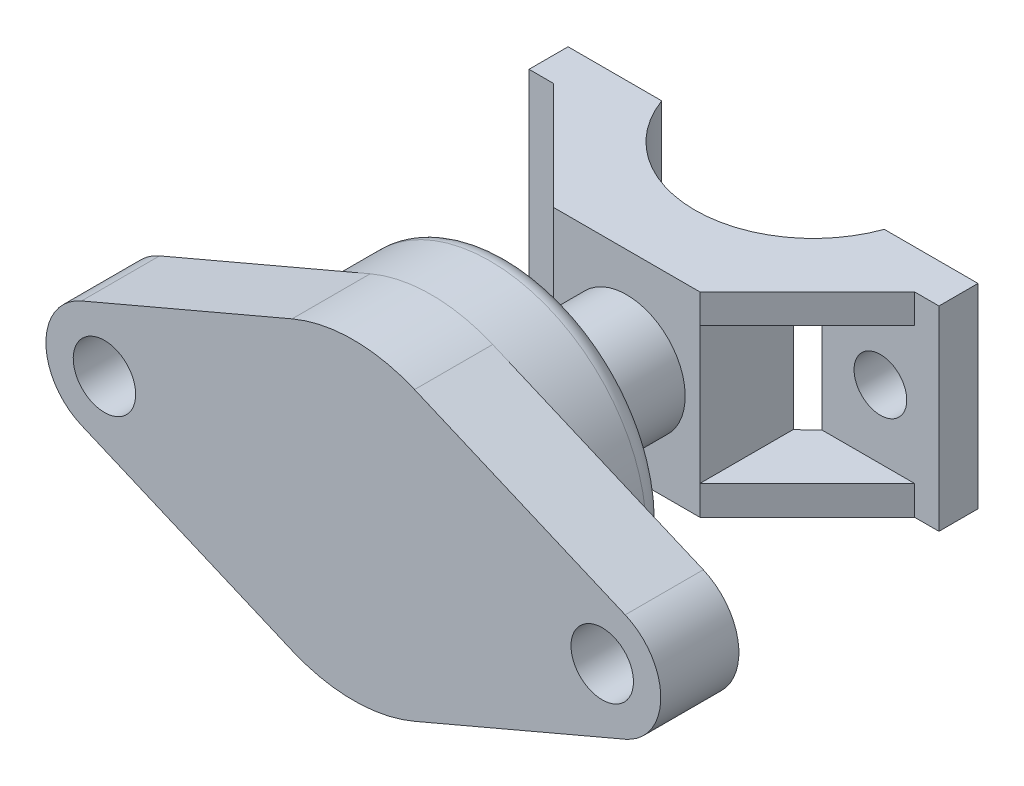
ISO-10303-21;
HEADER;
FILE_DESCRIPTION(('STEP AP214'),'2;1');
FILE_NAME('part.step','',(''),(''),'','','');
FILE_SCHEMA(('AUTOMOTIVE_DESIGN { 1 0 10303 214 1 1 1 1 }'));
ENDSEC;
DATA;
#1=APPLICATION_CONTEXT('core data for automotive mechanical design processes');
#2=APPLICATION_PROTOCOL_DEFINITION('international standard','automotive_design',2000,#1);
#3=PRODUCT_CONTEXT('',#1,'mechanical');
#4=PRODUCT('Part','Part','',(#3));
#5=PRODUCT_RELATED_PRODUCT_CATEGORY('part','',(#4));
#6=PRODUCT_DEFINITION_FORMATION('','',#4);
#7=PRODUCT_DEFINITION_CONTEXT('part definition',#1,'design');
#8=PRODUCT_DEFINITION('design','',#6,#7);
#9=PRODUCT_DEFINITION_SHAPE('','',#8);
#10=(LENGTH_UNIT() NAMED_UNIT(*) SI_UNIT(.MILLI.,.METRE.));
#11=(NAMED_UNIT(*) PLANE_ANGLE_UNIT() SI_UNIT($,.RADIAN.));
#12=(NAMED_UNIT(*) SI_UNIT($,.STERADIAN.) SOLID_ANGLE_UNIT());
#13=UNCERTAINTY_MEASURE_WITH_UNIT(LENGTH_MEASURE(1.E-05),#10,'distance_accuracy_value','');
#14=(GEOMETRIC_REPRESENTATION_CONTEXT(3) GLOBAL_UNCERTAINTY_ASSIGNED_CONTEXT((#13)) GLOBAL_UNIT_ASSIGNED_CONTEXT((#10,
#11,#12)) REPRESENTATION_CONTEXT('',''));
#15=CARTESIAN_POINT('',(0.,0.,0.));
#16=DIRECTION('',(0.,0.,1.));
#17=DIRECTION('',(1.,0.,0.));
#18=AXIS2_PLACEMENT_3D('',#15,#16,#17);
#19=CARTESIAN_POINT('',(15.,22.5,-78.));
#20=DIRECTION('',(0.,0.,1.));
#21=DIRECTION('',(1.,0.,0.));
#22=AXIS2_PLACEMENT_3D('',#19,#20,#21);
#23=CYLINDRICAL_SURFACE('',#22,2.7);
#24=CARTESIAN_POINT('',(15.,22.5,-78.));
#25=DIRECTION('',(0.,0.,1.));
#26=DIRECTION('',(1.,0.,0.));
#27=AXIS2_PLACEMENT_3D('',#24,#25,#26);
#28=CIRCLE('',#27,2.7);
#29=CARTESIAN_POINT('',(15.,25.2,-78.));
#30=VERTEX_POINT('',#29);
#31=EDGE_CURVE('E35',#30,#30,#28,.T.);
#32=ORIENTED_EDGE('',*,*,#31,.F.);
#33=EDGE_LOOP('',(#32));
#34=FACE_BOUND('',#33,.T.);
#35=CARTESIAN_POINT('',(15.,22.5,-74.));
#36=DIRECTION('',(0.,0.,1.));
#37=DIRECTION('',(1.,0.,0.));
#38=AXIS2_PLACEMENT_3D('',#35,#36,#37);
#39=CIRCLE('',#38,2.7);
#40=CARTESIAN_POINT('',(15.,25.2,-74.));
#41=VERTEX_POINT('',#40);
#42=EDGE_CURVE('E400',#41,#41,#39,.F.);
#43=ORIENTED_EDGE('',*,*,#42,.F.);
#44=EDGE_LOOP('',(#43));
#45=FACE_BOUND('',#44,.T.);
#46=ADVANCED_FACE('F16',(#34,#45),#23,.F.);
#47=CARTESIAN_POINT('',(-15.,22.5,-78.));
#48=DIRECTION('',(0.,0.,1.));
#49=DIRECTION('',(1.,0.,0.));
#50=AXIS2_PLACEMENT_3D('',#47,#48,#49);
#51=CYLINDRICAL_SURFACE('',#50,2.7);
#52=CARTESIAN_POINT('',(-15.,22.5,-78.));
#53=DIRECTION('',(0.,0.,1.));
#54=DIRECTION('',(1.,0.,0.));
#55=AXIS2_PLACEMENT_3D('',#52,#53,#54);
#56=CIRCLE('',#55,2.7);
#57=CARTESIAN_POINT('',(-15.,19.8,-78.));
#58=VERTEX_POINT('',#57);
#59=EDGE_CURVE('E19',#58,#58,#56,.T.);
#60=ORIENTED_EDGE('',*,*,#59,.F.);
#61=EDGE_LOOP('',(#60));
#62=FACE_BOUND('',#61,.T.);
#63=CARTESIAN_POINT('',(-15.,22.5,-74.));
#64=DIRECTION('',(0.,0.,1.));
#65=DIRECTION('',(1.,0.,0.));
#66=AXIS2_PLACEMENT_3D('',#63,#64,#65);
#67=CIRCLE('',#66,2.7);
#68=CARTESIAN_POINT('',(-15.,19.8,-74.));
#69=VERTEX_POINT('',#68);
#70=EDGE_CURVE('E418',#69,#69,#67,.F.);
#71=ORIENTED_EDGE('',*,*,#70,.F.);
#72=EDGE_LOOP('',(#71));
#73=FACE_BOUND('',#72,.T.);
#74=ADVANCED_FACE('F983',(#62,#73),#51,.F.);
#75=CARTESIAN_POINT('',(13.,15.5,-68.5));
#76=DIRECTION('',(0.,1.,0.));
#77=DIRECTION('',(0.,0.,1.));
#78=AXIS2_PLACEMENT_3D('',#75,#76,#77);
#79=PLANE('',#78);
#80=CARTESIAN_POINT('',(0.,15.5,-82.125));
#81=DIRECTION('',(0.,1.,0.));
#82=DIRECTION('',(0.,0.,1.));
#83=AXIS2_PLACEMENT_3D('',#80,#81,#82);
#84=CIRCLE('',#83,12.1249999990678);
#85=CARTESIAN_POINT('',(8.9999999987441,15.5,-74.));
#86=VERTEX_POINT('',#85);
#87=CARTESIAN_POINT('',(7.5,15.5,-72.5979004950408));
#88=VERTEX_POINT('',#87);
#89=EDGE_CURVE('E402',#86,#88,#84,.F.);
#90=ORIENTED_EDGE('',*,*,#89,.T.);
#91=DIRECTION('',(0.,0.,-1.));
#92=VECTOR('',#91,1.);
#93=CARTESIAN_POINT('',(7.5,15.5,-68.5));
#94=LINE('',#93,#92);
#95=CARTESIAN_POINT('',(7.5,15.5,-63.));
#96=VERTEX_POINT('',#95);
#97=EDGE_CURVE('E430',#96,#88,#94,.T.);
#98=ORIENTED_EDGE('',*,*,#97,.F.);
#99=DIRECTION('',(0.707106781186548,0.,-0.707106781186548));
#100=VECTOR('',#99,1.);
#101=CARTESIAN_POINT('',(7.5,15.5,-63.));
#102=LINE('',#101,#100);
#103=CARTESIAN_POINT('',(18.5,15.5,-74.));
#104=VERTEX_POINT('',#103);
#105=EDGE_CURVE('E317',#104,#96,#102,.F.);
#106=ORIENTED_EDGE('',*,*,#105,.F.);
#107=DIRECTION('',(1.,0.,0.));
#108=VECTOR('',#107,1.);
#109=CARTESIAN_POINT('',(18.5,15.5,-74.));
#110=LINE('',#109,#108);
#111=EDGE_CURVE('E461',#86,#104,#110,.T.);
#112=ORIENTED_EDGE('',*,*,#111,.F.);
#113=EDGE_LOOP('',(#90,#98,#106,#112));
#114=FACE_BOUND('',#113,.T.);
#115=ADVANCED_FACE('F975',(#114),#79,.T.);
#116=CARTESIAN_POINT('',(13.,29.5,-68.5));
#117=DIRECTION('',(0.,-1.,0.));
#118=DIRECTION('',(0.,0.,-1.));
#119=AXIS2_PLACEMENT_3D('',#116,#117,#118);
#120=PLANE('',#119);
#121=CARTESIAN_POINT('',(0.,29.5,-82.125));
#122=DIRECTION('',(0.,1.,0.));
#123=DIRECTION('',(0.,0.,1.));
#124=AXIS2_PLACEMENT_3D('',#121,#122,#123);
#125=CIRCLE('',#124,12.1249999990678);
#126=CARTESIAN_POINT('',(7.5,29.5,-72.5979004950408));
#127=VERTEX_POINT('',#126);
#128=CARTESIAN_POINT('',(8.9999999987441,29.5,-74.));
#129=VERTEX_POINT('',#128);
#130=EDGE_CURVE('E507',#127,#129,#125,.T.);
#131=ORIENTED_EDGE('',*,*,#130,.T.);
#132=DIRECTION('',(1.,0.,0.));
#133=VECTOR('',#132,1.);
#134=CARTESIAN_POINT('',(18.5,29.5,-74.));
#135=LINE('',#134,#133);
#136=CARTESIAN_POINT('',(18.5,29.5,-74.));
#137=VERTEX_POINT('',#136);
#138=EDGE_CURVE('E388',#137,#129,#135,.F.);
#139=ORIENTED_EDGE('',*,*,#138,.F.);
#140=DIRECTION('',(0.707106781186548,0.,-0.707106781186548));
#141=VECTOR('',#140,1.);
#142=CARTESIAN_POINT('',(7.5,29.5,-63.));
#143=LINE('',#142,#141);
#144=CARTESIAN_POINT('',(7.5,29.5,-63.));
#145=VERTEX_POINT('',#144);
#146=EDGE_CURVE('E433',#145,#137,#143,.T.);
#147=ORIENTED_EDGE('',*,*,#146,.F.);
#148=DIRECTION('',(0.,0.,-1.));
#149=VECTOR('',#148,1.);
#150=CARTESIAN_POINT('',(7.5,29.5,-68.5));
#151=LINE('',#150,#149);
#152=EDGE_CURVE('E429',#127,#145,#151,.F.);
#153=ORIENTED_EDGE('',*,*,#152,.F.);
#154=EDGE_LOOP('',(#131,#139,#147,#153));
#155=FACE_BOUND('',#154,.T.);
#156=ADVANCED_FACE('F968',(#155),#120,.T.);
#157=CARTESIAN_POINT('',(-21.,32.5,-78.));
#158=DIRECTION('',(-1.,0.,0.));
#159=DIRECTION('',(0.,0.,1.));
#160=AXIS2_PLACEMENT_3D('',#157,#158,#159);
#161=PLANE('',#160);
#162=DIRECTION('',(0.,0.,-1.));
#163=VECTOR('',#162,1.);
#164=CARTESIAN_POINT('',(-21.,32.5,-71.560139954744));
#165=LINE('',#164,#163);
#166=CARTESIAN_POINT('',(-21.,32.5,-74.));
#167=VERTEX_POINT('',#166);
#168=CARTESIAN_POINT('',(-21.,32.5,-78.));
#169=VERTEX_POINT('',#168);
#170=EDGE_CURVE('E310',#167,#169,#165,.T.);
#171=ORIENTED_EDGE('',*,*,#170,.T.);
#172=DIRECTION('',(0.,1.,0.));
#173=VECTOR('',#172,1.);
#174=CARTESIAN_POINT('',(-21.,32.5,-78.));
#175=LINE('',#174,#173);
#176=CARTESIAN_POINT('',(-21.,12.5,-78.));
#177=VERTEX_POINT('',#176);
#178=EDGE_CURVE('E403',#177,#169,#175,.T.);
#179=ORIENTED_EDGE('',*,*,#178,.F.);
#180=DIRECTION('',(0.,0.,-1.));
#181=VECTOR('',#180,1.);
#182=CARTESIAN_POINT('',(-21.,12.5,-71.560139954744));
#183=LINE('',#182,#181);
#184=CARTESIAN_POINT('',(-21.,12.5,-74.));
#185=VERTEX_POINT('',#184);
#186=EDGE_CURVE('E330',#185,#177,#183,.T.);
#187=ORIENTED_EDGE('',*,*,#186,.F.);
#188=DIRECTION('',(0.,1.,0.));
#189=VECTOR('',#188,1.);
#190=CARTESIAN_POINT('',(-21.,32.5,-74.));
#191=LINE('',#190,#189);
#192=EDGE_CURVE('E377',#167,#185,#191,.F.);
#193=ORIENTED_EDGE('',*,*,#192,.F.);
#194=EDGE_LOOP('',(#171,#179,#187,#193));
#195=FACE_BOUND('',#194,.T.);
#196=ADVANCED_FACE('F577',(#195),#161,.T.);
#197=CARTESIAN_POINT('',(-11.40175425,32.5,-78.));
#198=DIRECTION('',(0.,0.,-1.));
#199=DIRECTION('',(-1.,0.,0.));
#200=AXIS2_PLACEMENT_3D('',#197,#198,#199);
#201=PLANE('',#200);
#202=ORIENTED_EDGE('',*,*,#59,.T.);
#203=EDGE_LOOP('',(#202));
#204=FACE_BOUND('',#203,.T.);
#205=DIRECTION('',(1.,0.,0.));
#206=VECTOR('',#205,1.);
#207=CARTESIAN_POINT('',(0.,32.5,-78.));
#208=LINE('',#207,#206);
#209=CARTESIAN_POINT('',(-11.40175425,32.5,-78.));
#210=VERTEX_POINT('',#209);
#211=EDGE_CURVE('E308',#169,#210,#208,.T.);
#212=ORIENTED_EDGE('',*,*,#211,.T.);
#213=DIRECTION('',(0.,1.,0.));
#214=VECTOR('',#213,1.);
#215=CARTESIAN_POINT('',(-11.40175425,32.5,-78.));
#216=LINE('',#215,#214);
#217=CARTESIAN_POINT('',(-11.40175425,12.5,-78.));
#218=VERTEX_POINT('',#217);
#219=EDGE_CURVE('E399',#210,#218,#216,.F.);
#220=ORIENTED_EDGE('',*,*,#219,.T.);
#221=DIRECTION('',(1.,0.,0.));
#222=VECTOR('',#221,1.);
#223=CARTESIAN_POINT('',(0.,12.5,-78.));
#224=LINE('',#223,#222);
#225=EDGE_CURVE('E327',#177,#218,#224,.T.);
#226=ORIENTED_EDGE('',*,*,#225,.F.);
#227=ORIENTED_EDGE('',*,*,#178,.T.);
#228=EDGE_LOOP('',(#212,#220,#226,#227));
#229=FACE_BOUND('',#228,.T.);
#230=ADVANCED_FACE('F573',(#204,#229),#201,.T.);
#231=CARTESIAN_POINT('',(21.,32.5,-78.));
#232=DIRECTION('',(0.,0.,-1.));
#233=DIRECTION('',(-1.,0.,0.));
#234=AXIS2_PLACEMENT_3D('',#231,#232,#233);
#235=PLANE('',#234);
#236=ORIENTED_EDGE('',*,*,#31,.T.);
#237=EDGE_LOOP('',(#236));
#238=FACE_BOUND('',#237,.T.);
#239=DIRECTION('',(1.,0.,0.));
#240=VECTOR('',#239,1.);
#241=CARTESIAN_POINT('',(0.,32.5,-78.));
#242=LINE('',#241,#240);
#243=CARTESIAN_POINT('',(11.40175425,32.5,-78.));
#244=VERTEX_POINT('',#243);
#245=CARTESIAN_POINT('',(21.,32.5,-78.));
#246=VERTEX_POINT('',#245);
#247=EDGE_CURVE('E303',#244,#246,#242,.T.);
#248=ORIENTED_EDGE('',*,*,#247,.T.);
#249=DIRECTION('',(0.,1.,0.));
#250=VECTOR('',#249,1.);
#251=CARTESIAN_POINT('',(21.,32.5,-78.));
#252=LINE('',#251,#250);
#253=CARTESIAN_POINT('',(21.,12.5,-78.));
#254=VERTEX_POINT('',#253);
#255=EDGE_CURVE('E389',#254,#246,#252,.T.);
#256=ORIENTED_EDGE('',*,*,#255,.F.);
#257=DIRECTION('',(1.,0.,0.));
#258=VECTOR('',#257,1.);
#259=CARTESIAN_POINT('',(0.,12.5,-78.));
#260=LINE('',#259,#258);
#261=CARTESIAN_POINT('',(11.40175425,12.5,-78.));
#262=VERTEX_POINT('',#261);
#263=EDGE_CURVE('E321',#262,#254,#260,.T.);
#264=ORIENTED_EDGE('',*,*,#263,.F.);
#265=DIRECTION('',(0.,1.,0.));
#266=VECTOR('',#265,1.);
#267=CARTESIAN_POINT('',(11.40175425,32.5,-78.));
#268=LINE('',#267,#266);
#269=EDGE_CURVE('E397',#262,#244,#268,.T.);
#270=ORIENTED_EDGE('',*,*,#269,.T.);
#271=EDGE_LOOP('',(#248,#256,#264,#270));
#272=FACE_BOUND('',#271,.T.);
#273=ADVANCED_FACE('F576',(#238,#272),#235,.T.);
#274=CARTESIAN_POINT('',(21.,32.5,-74.));
#275=DIRECTION('',(1.,0.,0.));
#276=DIRECTION('',(0.,0.,-1.));
#277=AXIS2_PLACEMENT_3D('',#274,#275,#276);
#278=PLANE('',#277);
#279=DIRECTION('',(0.,0.,-1.));
#280=VECTOR('',#279,1.);
#281=CARTESIAN_POINT('',(21.,32.5,-71.560139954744));
#282=LINE('',#281,#280);
#283=CARTESIAN_POINT('',(21.,32.5,-74.));
#284=VERTEX_POINT('',#283);
#285=EDGE_CURVE('E302',#246,#284,#282,.F.);
#286=ORIENTED_EDGE('',*,*,#285,.T.);
#287=DIRECTION('',(0.,1.,0.));
#288=VECTOR('',#287,1.);
#289=CARTESIAN_POINT('',(21.,32.5,-74.));
#290=LINE('',#289,#288);
#291=CARTESIAN_POINT('',(21.,12.5,-74.));
#292=VERTEX_POINT('',#291);
#293=EDGE_CURVE('E385',#292,#284,#290,.T.);
#294=ORIENTED_EDGE('',*,*,#293,.F.);
#295=DIRECTION('',(0.,0.,-1.));
#296=VECTOR('',#295,1.);
#297=CARTESIAN_POINT('',(21.,12.5,-71.560139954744));
#298=LINE('',#297,#296);
#299=EDGE_CURVE('E320',#254,#292,#298,.F.);
#300=ORIENTED_EDGE('',*,*,#299,.F.);
#301=ORIENTED_EDGE('',*,*,#255,.T.);
#302=EDGE_LOOP('',(#286,#294,#300,#301));
#303=FACE_BOUND('',#302,.T.);
#304=ADVANCED_FACE('F597',(#303),#278,.T.);
#305=CARTESIAN_POINT('',(18.5,32.5,-74.));
#306=DIRECTION('',(0.,0.,1.));
#307=DIRECTION('',(1.,0.,0.));
#308=AXIS2_PLACEMENT_3D('',#305,#306,#307);
#309=PLANE('',#308);
#310=ORIENTED_EDGE('',*,*,#42,.T.);
#311=EDGE_LOOP('',(#310));
#312=FACE_BOUND('',#311,.T.);
#313=ORIENTED_EDGE('',*,*,#111,.T.);
#314=DIRECTION('',(0.,1.,0.));
#315=VECTOR('',#314,1.);
#316=CARTESIAN_POINT('',(18.5,32.5,-74.));
#317=LINE('',#316,#315);
#318=CARTESIAN_POINT('',(18.5,12.5,-74.));
#319=VERTEX_POINT('',#318);
#320=EDGE_CURVE('E316',#319,#104,#317,.T.);
#321=ORIENTED_EDGE('',*,*,#320,.F.);
#322=DIRECTION('',(1.,0.,0.));
#323=VECTOR('',#322,1.);
#324=CARTESIAN_POINT('',(0.,12.5,-74.));
#325=LINE('',#324,#323);
#326=EDGE_CURVE('E318',#292,#319,#325,.F.);
#327=ORIENTED_EDGE('',*,*,#326,.F.);
#328=ORIENTED_EDGE('',*,*,#293,.T.);
#329=DIRECTION('',(1.,0.,0.));
#330=VECTOR('',#329,1.);
#331=CARTESIAN_POINT('',(0.,32.5,-74.));
#332=LINE('',#331,#330);
#333=CARTESIAN_POINT('',(18.5,32.5,-74.));
#334=VERTEX_POINT('',#333);
#335=EDGE_CURVE('E300',#284,#334,#332,.F.);
#336=ORIENTED_EDGE('',*,*,#335,.T.);
#337=DIRECTION('',(0.,1.,0.));
#338=VECTOR('',#337,1.);
#339=CARTESIAN_POINT('',(18.5,32.5,-74.));
#340=LINE('',#339,#338);
#341=EDGE_CURVE('E414',#137,#334,#340,.T.);
#342=ORIENTED_EDGE('',*,*,#341,.F.);
#343=ORIENTED_EDGE('',*,*,#138,.T.);
#344=DIRECTION('',(0.,1.,0.));
#345=VECTOR('',#344,1.);
#346=CARTESIAN_POINT('',(8.99999999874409,32.5,-74.));
#347=LINE('',#346,#345);
#348=EDGE_CURVE('E503',#129,#86,#347,.F.);
#349=ORIENTED_EDGE('',*,*,#348,.T.);
#350=EDGE_LOOP('',(#313,#321,#327,#328,#336,#342,#343,#349));
#351=FACE_BOUND('',#350,.T.);
#352=ADVANCED_FACE('F620',(#312,#351),#309,.T.);
#353=CARTESIAN_POINT('',(0.,32.5,-82.125));
#354=DIRECTION('',(0.,1.,0.));
#355=DIRECTION('',(0.,0.,1.));
#356=AXIS2_PLACEMENT_3D('',#353,#354,#355);
#357=CYLINDRICAL_SURFACE('',#356,12.1249999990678);
#358=CARTESIAN_POINT('',(0.,15.5,-82.125));
#359=DIRECTION('',(0.,1.,0.));
#360=DIRECTION('',(0.,0.,1.));
#361=AXIS2_PLACEMENT_3D('',#358,#359,#360);
#362=CIRCLE('',#361,12.1249999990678);
#363=CARTESIAN_POINT('',(-7.5,15.5,-72.5979004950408));
#364=VERTEX_POINT('',#363);
#365=CARTESIAN_POINT('',(-8.99999999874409,15.5,-74.));
#366=VERTEX_POINT('',#365);
#367=EDGE_CURVE('E496',#364,#366,#362,.F.);
#368=ORIENTED_EDGE('',*,*,#367,.F.);
#369=DIRECTION('',(0.,1.,0.));
#370=VECTOR('',#369,1.);
#371=CARTESIAN_POINT('',(-7.5,22.5,-72.5979004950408));
#372=LINE('',#371,#370);
#373=CARTESIAN_POINT('',(-7.5,29.5,-72.5979004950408));
#374=VERTEX_POINT('',#373);
#375=EDGE_CURVE('E333',#374,#364,#372,.F.);
#376=ORIENTED_EDGE('',*,*,#375,.F.);
#377=CARTESIAN_POINT('',(0.,29.5,-82.125));
#378=DIRECTION('',(0.,1.,0.));
#379=DIRECTION('',(0.,0.,1.));
#380=AXIS2_PLACEMENT_3D('',#377,#378,#379);
#381=CIRCLE('',#380,12.1249999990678);
#382=CARTESIAN_POINT('',(-8.99999999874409,29.5,-74.));
#383=VERTEX_POINT('',#382);
#384=EDGE_CURVE('E506',#383,#374,#381,.T.);
#385=ORIENTED_EDGE('',*,*,#384,.F.);
#386=DIRECTION('',(0.,1.,0.));
#387=VECTOR('',#386,1.);
#388=CARTESIAN_POINT('',(-8.99999999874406,32.5,-74.));
#389=LINE('',#388,#387);
#390=EDGE_CURVE('E378',#366,#383,#389,.T.);
#391=ORIENTED_EDGE('',*,*,#390,.F.);
#392=EDGE_LOOP('',(#368,#376,#385,#391));
#393=FACE_BOUND('',#392,.T.);
#394=ORIENTED_EDGE('',*,*,#130,.F.);
#395=DIRECTION('',(0.,1.,0.));
#396=VECTOR('',#395,1.);
#397=CARTESIAN_POINT('',(7.5,22.5,-72.5979004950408));
#398=LINE('',#397,#396);
#399=EDGE_CURVE('E426',#88,#127,#398,.T.);
#400=ORIENTED_EDGE('',*,*,#399,.F.);
#401=ORIENTED_EDGE('',*,*,#89,.F.);
#402=ORIENTED_EDGE('',*,*,#348,.F.);
#403=EDGE_LOOP('',(#394,#400,#401,#402));
#404=FACE_BOUND('',#403,.T.);
#405=ORIENTED_EDGE('',*,*,#219,.F.);
#406=CARTESIAN_POINT('',(0.,32.5,-82.125));
#407=DIRECTION('',(0.,1.,0.));
#408=DIRECTION('',(0.,0.,1.));
#409=AXIS2_PLACEMENT_3D('',#406,#407,#408);
#410=CIRCLE('',#409,12.1249999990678);
#411=EDGE_CURVE('E305',#210,#244,#410,.T.);
#412=ORIENTED_EDGE('',*,*,#411,.T.);
#413=ORIENTED_EDGE('',*,*,#269,.F.);
#414=CARTESIAN_POINT('',(0.,12.5,-82.125));
#415=DIRECTION('',(0.,1.,0.));
#416=DIRECTION('',(0.,0.,1.));
#417=AXIS2_PLACEMENT_3D('',#414,#415,#416);
#418=CIRCLE('',#417,12.1249999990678);
#419=EDGE_CURVE('E324',#218,#262,#418,.T.);
#420=ORIENTED_EDGE('',*,*,#419,.F.);
#421=EDGE_LOOP('',(#405,#412,#413,#420));
#422=FACE_BOUND('',#421,.T.);
#423=ADVANCED_FACE('F587',(#393,#404,#422),#357,.F.);
#424=CARTESIAN_POINT('',(-13.,29.5,-68.5));
#425=DIRECTION('',(0.,-1.,0.));
#426=DIRECTION('',(0.,0.,-1.));
#427=AXIS2_PLACEMENT_3D('',#424,#425,#426);
#428=PLANE('',#427);
#429=DIRECTION('',(0.707106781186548,0.,0.707106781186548));
#430=VECTOR('',#429,1.);
#431=CARTESIAN_POINT('',(-18.5,29.5,-74.));
#432=LINE('',#431,#430);
#433=CARTESIAN_POINT('',(-18.5,29.5,-74.));
#434=VERTEX_POINT('',#433);
#435=CARTESIAN_POINT('',(-7.5,29.5,-63.));
#436=VERTEX_POINT('',#435);
#437=EDGE_CURVE('E299',#434,#436,#432,.T.);
#438=ORIENTED_EDGE('',*,*,#437,.F.);
#439=DIRECTION('',(1.,0.,0.));
#440=VECTOR('',#439,1.);
#441=CARTESIAN_POINT('',(-21.,29.5,-74.));
#442=LINE('',#441,#440);
#443=EDGE_CURVE('E374',#383,#434,#442,.F.);
#444=ORIENTED_EDGE('',*,*,#443,.F.);
#445=ORIENTED_EDGE('',*,*,#384,.T.);
#446=DIRECTION('',(0.,0.,1.));
#447=VECTOR('',#446,1.);
#448=CARTESIAN_POINT('',(-7.5,29.5,-68.5));
#449=LINE('',#448,#447);
#450=EDGE_CURVE('E338',#436,#374,#449,.F.);
#451=ORIENTED_EDGE('',*,*,#450,.F.);
#452=EDGE_LOOP('',(#438,#444,#445,#451));
#453=FACE_BOUND('',#452,.T.);
#454=ADVANCED_FACE('F638',(#453),#428,.T.);
#455=CARTESIAN_POINT('',(-13.,15.5,-68.5));
#456=DIRECTION('',(0.,1.,0.));
#457=DIRECTION('',(0.,0.,1.));
#458=AXIS2_PLACEMENT_3D('',#455,#456,#457);
#459=PLANE('',#458);
#460=DIRECTION('',(0.707106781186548,0.,0.707106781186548));
#461=VECTOR('',#460,1.);
#462=CARTESIAN_POINT('',(-18.5,15.5,-74.));
#463=LINE('',#462,#461);
#464=CARTESIAN_POINT('',(-7.5,15.5,-63.));
#465=VERTEX_POINT('',#464);
#466=CARTESIAN_POINT('',(-18.5,15.5,-74.));
#467=VERTEX_POINT('',#466);
#468=EDGE_CURVE('E341',#465,#467,#463,.F.);
#469=ORIENTED_EDGE('',*,*,#468,.F.);
#470=DIRECTION('',(0.,0.,1.));
#471=VECTOR('',#470,1.);
#472=CARTESIAN_POINT('',(-7.5,15.5,-68.5));
#473=LINE('',#472,#471);
#474=EDGE_CURVE('E336',#364,#465,#473,.T.);
#475=ORIENTED_EDGE('',*,*,#474,.F.);
#476=ORIENTED_EDGE('',*,*,#367,.T.);
#477=DIRECTION('',(1.,0.,0.));
#478=VECTOR('',#477,1.);
#479=CARTESIAN_POINT('',(-21.,15.5,-74.));
#480=LINE('',#479,#478);
#481=EDGE_CURVE('E493',#467,#366,#480,.T.);
#482=ORIENTED_EDGE('',*,*,#481,.F.);
#483=EDGE_LOOP('',(#469,#475,#476,#482));
#484=FACE_BOUND('',#483,.T.);
#485=ADVANCED_FACE('F633',(#484),#459,.T.);
#486=CARTESIAN_POINT('',(-21.,32.5,-74.));
#487=DIRECTION('',(0.,0.,1.));
#488=DIRECTION('',(1.,0.,0.));
#489=AXIS2_PLACEMENT_3D('',#486,#487,#488);
#490=PLANE('',#489);
#491=ORIENTED_EDGE('',*,*,#70,.T.);
#492=EDGE_LOOP('',(#491));
#493=FACE_BOUND('',#492,.T.);
#494=DIRECTION('',(1.,0.,0.));
#495=VECTOR('',#494,1.);
#496=CARTESIAN_POINT('',(0.,32.5,-74.));
#497=LINE('',#496,#495);
#498=CARTESIAN_POINT('',(-18.5,32.5,-74.));
#499=VERTEX_POINT('',#498);
#500=EDGE_CURVE('E409',#499,#167,#497,.F.);
#501=ORIENTED_EDGE('',*,*,#500,.T.);
#502=ORIENTED_EDGE('',*,*,#192,.T.);
#503=DIRECTION('',(1.,0.,0.));
#504=VECTOR('',#503,1.);
#505=CARTESIAN_POINT('',(0.,12.5,-74.));
#506=LINE('',#505,#504);
#507=CARTESIAN_POINT('',(-18.5,12.5,-74.));
#508=VERTEX_POINT('',#507);
#509=EDGE_CURVE('E476',#508,#185,#506,.F.);
#510=ORIENTED_EDGE('',*,*,#509,.F.);
#511=DIRECTION('',(0.,1.,0.));
#512=VECTOR('',#511,1.);
#513=CARTESIAN_POINT('',(-18.5,32.5,-74.));
#514=LINE('',#513,#512);
#515=EDGE_CURVE('E366',#467,#508,#514,.F.);
#516=ORIENTED_EDGE('',*,*,#515,.F.);
#517=ORIENTED_EDGE('',*,*,#481,.T.);
#518=ORIENTED_EDGE('',*,*,#390,.T.);
#519=ORIENTED_EDGE('',*,*,#443,.T.);
#520=DIRECTION('',(0.,1.,0.));
#521=VECTOR('',#520,1.);
#522=CARTESIAN_POINT('',(-18.5,32.5,-74.));
#523=LINE('',#522,#521);
#524=EDGE_CURVE('E337',#499,#434,#523,.F.);
#525=ORIENTED_EDGE('',*,*,#524,.F.);
#526=EDGE_LOOP('',(#501,#502,#510,#516,#517,#518,#519,#525));
#527=FACE_BOUND('',#526,.T.);
#528=ADVANCED_FACE('F608',(#493,#527),#490,.T.);
#529=CARTESIAN_POINT('',(0.,12.5,-71.560139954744));
#530=DIRECTION('',(0.,-1.,0.));
#531=DIRECTION('',(0.,0.,-1.));
#532=AXIS2_PLACEMENT_3D('',#529,#530,#531);
#533=PLANE('',#532);
#534=ORIENTED_EDGE('',*,*,#299,.T.);
#535=ORIENTED_EDGE('',*,*,#326,.T.);
#536=DIRECTION('',(0.707106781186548,0.,-0.707106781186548));
#537=VECTOR('',#536,1.);
#538=CARTESIAN_POINT('',(7.5,12.5,-63.));
#539=LINE('',#538,#537);
#540=CARTESIAN_POINT('',(7.5,12.5,-63.));
#541=VERTEX_POINT('',#540);
#542=EDGE_CURVE('E313',#541,#319,#539,.T.);
#543=ORIENTED_EDGE('',*,*,#542,.F.);
#544=DIRECTION('',(1.,0.,0.));
#545=VECTOR('',#544,1.);
#546=CARTESIAN_POINT('',(0.,12.5,-63.));
#547=LINE('',#546,#545);
#548=CARTESIAN_POINT('',(-7.5,12.5,-63.));
#549=VERTEX_POINT('',#548);
#550=EDGE_CURVE('E292',#549,#541,#547,.T.);
#551=ORIENTED_EDGE('',*,*,#550,.F.);
#552=DIRECTION('',(0.707106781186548,0.,0.707106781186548));
#553=VECTOR('',#552,1.);
#554=CARTESIAN_POINT('',(-18.5,12.5,-74.));
#555=LINE('',#554,#553);
#556=EDGE_CURVE('E296',#508,#549,#555,.T.);
#557=ORIENTED_EDGE('',*,*,#556,.F.);
#558=ORIENTED_EDGE('',*,*,#509,.T.);
#559=ORIENTED_EDGE('',*,*,#186,.T.);
#560=ORIENTED_EDGE('',*,*,#225,.T.);
#561=ORIENTED_EDGE('',*,*,#419,.T.);
#562=ORIENTED_EDGE('',*,*,#263,.T.);
#563=EDGE_LOOP('',(#534,#535,#543,#551,#557,#558,#559,#560,#561,#562));
#564=FACE_BOUND('',#563,.T.);
#565=ADVANCED_FACE('F600',(#564),#533,.T.);
#566=CARTESIAN_POINT('',(7.5,32.5,-63.));
#567=DIRECTION('',(0.707106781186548,0.,0.707106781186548));
#568=DIRECTION('',(0.707106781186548,0.,-0.707106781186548));
#569=AXIS2_PLACEMENT_3D('',#566,#567,#568);
#570=PLANE('',#569);
#571=ORIENTED_EDGE('',*,*,#542,.T.);
#572=ORIENTED_EDGE('',*,*,#320,.T.);
#573=ORIENTED_EDGE('',*,*,#105,.T.);
#574=DIRECTION('',(0.,1.,0.));
#575=VECTOR('',#574,1.);
#576=CARTESIAN_POINT('',(7.5,32.5,-63.));
#577=LINE('',#576,#575);
#578=EDGE_CURVE('E295',#541,#96,#577,.T.);
#579=ORIENTED_EDGE('',*,*,#578,.F.);
#580=EDGE_LOOP('',(#571,#572,#573,#579));
#581=FACE_BOUND('',#580,.T.);
#582=ADVANCED_FACE('F625',(#581),#570,.T.);
#583=CARTESIAN_POINT('',(7.5,22.5,-68.5));
#584=DIRECTION('',(1.,0.,0.));
#585=DIRECTION('',(0.,0.,-1.));
#586=AXIS2_PLACEMENT_3D('',#583,#584,#585);
#587=PLANE('',#586);
#588=DIRECTION('',(0.,1.,0.));
#589=VECTOR('',#588,1.);
#590=CARTESIAN_POINT('',(7.5,32.5,-63.));
#591=LINE('',#590,#589);
#592=EDGE_CURVE('E440',#96,#145,#591,.T.);
#593=ORIENTED_EDGE('',*,*,#592,.F.);
#594=ORIENTED_EDGE('',*,*,#97,.T.);
#595=ORIENTED_EDGE('',*,*,#399,.T.);
#596=ORIENTED_EDGE('',*,*,#152,.T.);
#597=EDGE_LOOP('',(#593,#594,#595,#596));
#598=FACE_BOUND('',#597,.T.);
#599=ADVANCED_FACE('F894',(#598),#587,.T.);
#600=CARTESIAN_POINT('',(7.5,32.5,-63.));
#601=DIRECTION('',(0.707106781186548,0.,0.707106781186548));
#602=DIRECTION('',(0.707106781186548,0.,-0.707106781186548));
#603=AXIS2_PLACEMENT_3D('',#600,#601,#602);
#604=PLANE('',#603);
#605=DIRECTION('',(-0.707106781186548,0.,0.707106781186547));
#606=VECTOR('',#605,1.);
#607=CARTESIAN_POINT('',(18.5,32.5,-74.));
#608=LINE('',#607,#606);
#609=CARTESIAN_POINT('',(7.5,32.5,-63.));
#610=VERTEX_POINT('',#609);
#611=EDGE_CURVE('E297',#334,#610,#608,.T.);
#612=ORIENTED_EDGE('',*,*,#611,.T.);
#613=DIRECTION('',(0.,1.,0.));
#614=VECTOR('',#613,1.);
#615=CARTESIAN_POINT('',(7.5,32.5,-63.));
#616=LINE('',#615,#614);
#617=EDGE_CURVE('E291',#145,#610,#616,.T.);
#618=ORIENTED_EDGE('',*,*,#617,.F.);
#619=ORIENTED_EDGE('',*,*,#146,.T.);
#620=ORIENTED_EDGE('',*,*,#341,.T.);
#621=EDGE_LOOP('',(#612,#618,#619,#620));
#622=FACE_BOUND('',#621,.T.);
#623=ADVANCED_FACE('F617',(#622),#604,.T.);
#624=CARTESIAN_POINT('',(0.,32.5,-71.560139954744));
#625=DIRECTION('',(0.,-1.,0.));
#626=DIRECTION('',(0.,0.,-1.));
#627=AXIS2_PLACEMENT_3D('',#624,#625,#626);
#628=PLANE('',#627);
#629=ORIENTED_EDGE('',*,*,#611,.F.);
#630=ORIENTED_EDGE('',*,*,#335,.F.);
#631=ORIENTED_EDGE('',*,*,#285,.F.);
#632=ORIENTED_EDGE('',*,*,#247,.F.);
#633=ORIENTED_EDGE('',*,*,#411,.F.);
#634=ORIENTED_EDGE('',*,*,#211,.F.);
#635=ORIENTED_EDGE('',*,*,#170,.F.);
#636=ORIENTED_EDGE('',*,*,#500,.F.);
#637=DIRECTION('',(0.707106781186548,0.,0.707106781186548));
#638=VECTOR('',#637,1.);
#639=CARTESIAN_POINT('',(-18.5,32.5,-74.));
#640=LINE('',#639,#638);
#641=CARTESIAN_POINT('',(-7.5,32.5,-63.));
#642=VERTEX_POINT('',#641);
#643=EDGE_CURVE('E346',#642,#499,#640,.F.);
#644=ORIENTED_EDGE('',*,*,#643,.F.);
#645=DIRECTION('',(1.,0.,0.));
#646=VECTOR('',#645,1.);
#647=CARTESIAN_POINT('',(0.,32.5,-63.));
#648=LINE('',#647,#646);
#649=EDGE_CURVE('E281',#610,#642,#648,.F.);
#650=ORIENTED_EDGE('',*,*,#649,.F.);
#651=EDGE_LOOP('',(#629,#630,#631,#632,#633,#634,#635,#636,#644,#650));
#652=FACE_BOUND('',#651,.T.);
#653=ADVANCED_FACE('F590',(#652),#628,.F.);
#654=CARTESIAN_POINT('',(-18.5,32.5,-74.));
#655=DIRECTION('',(-0.707106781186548,0.,0.707106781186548));
#656=DIRECTION('',(0.707106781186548,0.,0.707106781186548));
#657=AXIS2_PLACEMENT_3D('',#654,#655,#656);
#658=PLANE('',#657);
#659=ORIENTED_EDGE('',*,*,#643,.T.);
#660=ORIENTED_EDGE('',*,*,#524,.T.);
#661=ORIENTED_EDGE('',*,*,#437,.T.);
#662=DIRECTION('',(0.,1.,0.));
#663=VECTOR('',#662,1.);
#664=CARTESIAN_POINT('',(-7.5,32.5,-63.));
#665=LINE('',#664,#663);
#666=EDGE_CURVE('E290',#642,#436,#665,.F.);
#667=ORIENTED_EDGE('',*,*,#666,.F.);
#668=EDGE_LOOP('',(#659,#660,#661,#667));
#669=FACE_BOUND('',#668,.T.);
#670=ADVANCED_FACE('F611',(#669),#658,.T.);
#671=CARTESIAN_POINT('',(-7.5,22.5,-68.5));
#672=DIRECTION('',(-1.,0.,0.));
#673=DIRECTION('',(0.,0.,1.));
#674=AXIS2_PLACEMENT_3D('',#671,#672,#673);
#675=PLANE('',#674);
#676=DIRECTION('',(0.,1.,0.));
#677=VECTOR('',#676,1.);
#678=CARTESIAN_POINT('',(-7.5,32.5,-63.));
#679=LINE('',#678,#677);
#680=EDGE_CURVE('E349',#436,#465,#679,.F.);
#681=ORIENTED_EDGE('',*,*,#680,.F.);
#682=ORIENTED_EDGE('',*,*,#450,.T.);
#683=ORIENTED_EDGE('',*,*,#375,.T.);
#684=ORIENTED_EDGE('',*,*,#474,.T.);
#685=EDGE_LOOP('',(#681,#682,#683,#684));
#686=FACE_BOUND('',#685,.T.);
#687=ADVANCED_FACE('F640',(#686),#675,.T.);
#688=CARTESIAN_POINT('',(-18.5,32.5,-74.));
#689=DIRECTION('',(-0.707106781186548,0.,0.707106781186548));
#690=DIRECTION('',(0.707106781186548,0.,0.707106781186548));
#691=AXIS2_PLACEMENT_3D('',#688,#689,#690);
#692=PLANE('',#691);
#693=ORIENTED_EDGE('',*,*,#556,.T.);
#694=DIRECTION('',(0.,1.,0.));
#695=VECTOR('',#694,1.);
#696=CARTESIAN_POINT('',(-7.5,32.5,-63.));
#697=LINE('',#696,#695);
#698=EDGE_CURVE('E352',#465,#549,#697,.F.);
#699=ORIENTED_EDGE('',*,*,#698,.F.);
#700=ORIENTED_EDGE('',*,*,#468,.T.);
#701=ORIENTED_EDGE('',*,*,#515,.T.);
#702=EDGE_LOOP('',(#693,#699,#700,#701));
#703=FACE_BOUND('',#702,.T.);
#704=ADVANCED_FACE('F629',(#703),#692,.T.);
#705=CARTESIAN_POINT('',(0.,32.5,-63.));
#706=DIRECTION('',(0.,0.,1.));
#707=DIRECTION('',(1.,0.,0.));
#708=AXIS2_PLACEMENT_3D('',#705,#706,#707);
#709=PLANE('',#708);
#710=CARTESIAN_POINT('',(0.,22.5,-63.));
#711=DIRECTION('',(0.,0.,1.));
#712=DIRECTION('',(1.,0.,0.));
#713=AXIS2_PLACEMENT_3D('',#710,#711,#712);
#714=CIRCLE('',#713,6.);
#715=CARTESIAN_POINT('',(0.,16.5,-63.));
#716=VERTEX_POINT('',#715);
#717=EDGE_CURVE('E371',#716,#716,#714,.T.);
#718=ORIENTED_EDGE('',*,*,#717,.F.);
#719=EDGE_LOOP('',(#718));
#720=FACE_BOUND('',#719,.T.);
#721=ORIENTED_EDGE('',*,*,#680,.T.);
#722=ORIENTED_EDGE('',*,*,#698,.T.);
#723=ORIENTED_EDGE('',*,*,#550,.T.);
#724=ORIENTED_EDGE('',*,*,#578,.T.);
#725=ORIENTED_EDGE('',*,*,#592,.T.);
#726=ORIENTED_EDGE('',*,*,#617,.T.);
#727=ORIENTED_EDGE('',*,*,#649,.T.);
#728=ORIENTED_EDGE('',*,*,#666,.T.);
#729=EDGE_LOOP('',(#721,#722,#723,#724,#725,#726,#727,#728));
#730=FACE_BOUND('',#729,.T.);
#731=ADVANCED_FACE('F614',(#720,#730),#709,.T.);
#732=CARTESIAN_POINT('',(0.,22.5,-49.));
#733=DIRECTION('',(0.,0.,1.));
#734=DIRECTION('',(1.,0.,0.));
#735=AXIS2_PLACEMENT_3D('',#732,#733,#734);
#736=CYLINDRICAL_SURFACE('',#735,6.);
#737=CARTESIAN_POINT('',(0.,22.5,-46.));
#738=DIRECTION('',(0.,0.,1.));
#739=DIRECTION('',(1.,0.,0.));
#740=AXIS2_PLACEMENT_3D('',#737,#738,#739);
#741=CIRCLE('',#740,6.);
#742=CARTESIAN_POINT('',(0.,16.5,-46.));
#743=VERTEX_POINT('',#742);
#744=EDGE_CURVE('E554',#743,#743,#741,.T.);
#745=ORIENTED_EDGE('',*,*,#744,.F.);
#746=EDGE_LOOP('',(#745));
#747=FACE_BOUND('',#746,.T.);
#748=ORIENTED_EDGE('',*,*,#717,.T.);
#749=EDGE_LOOP('',(#748));
#750=FACE_BOUND('',#749,.T.);
#751=ADVANCED_FACE('F856',(#747,#750),#736,.T.);
#752=CARTESIAN_POINT('',(0.,27.25,-46.));
#753=DIRECTION('',(0.,0.,-1.));
#754=DIRECTION('',(-1.,0.,0.));
#755=AXIS2_PLACEMENT_3D('',#752,#753,#754);
#756=PLANE('',#755);
#757=ORIENTED_EDGE('',*,*,#744,.T.);
#758=EDGE_LOOP('',(#757));
#759=FACE_BOUND('',#758,.T.);
#760=CARTESIAN_POINT('',(0.,22.5,-46.));
#761=DIRECTION('',(0.,0.,1.));
#762=DIRECTION('',(1.,0.,0.));
#763=AXIS2_PLACEMENT_3D('',#760,#761,#762);
#764=CIRCLE('',#763,9.5);
#765=CARTESIAN_POINT('',(0.,13.,-46.));
#766=VERTEX_POINT('',#765);
#767=EDGE_CURVE('E551',#766,#766,#764,.F.);
#768=ORIENTED_EDGE('',*,*,#767,.T.);
#769=EDGE_LOOP('',(#768));
#770=FACE_BOUND('',#769,.T.);
#771=ADVANCED_FACE('F849',(#759,#770),#756,.T.);
#772=CARTESIAN_POINT('',(0.,22.5,-48.5));
#773=DIRECTION('',(0.,0.,1.));
#774=DIRECTION('',(1.,0.,0.));
#775=AXIS2_PLACEMENT_3D('',#772,#773,#774);
#776=CYLINDRICAL_SURFACE('',#775,9.5);
#777=ORIENTED_EDGE('',*,*,#767,.F.);
#778=EDGE_LOOP('',(#777));
#779=FACE_BOUND('',#778,.T.);
#780=CARTESIAN_POINT('',(0.,22.5,-51.));
#781=DIRECTION('',(0.,0.,1.));
#782=DIRECTION('',(1.,0.,0.));
#783=AXIS2_PLACEMENT_3D('',#780,#781,#782);
#784=CIRCLE('',#783,9.5);
#785=CARTESIAN_POINT('',(0.,13.,-51.));
#786=VERTEX_POINT('',#785);
#787=EDGE_CURVE('E247',#786,#786,#784,.T.);
#788=ORIENTED_EDGE('',*,*,#787,.F.);
#789=EDGE_LOOP('',(#788));
#790=FACE_BOUND('',#789,.T.);
#791=ADVANCED_FACE('F774',(#779,#790),#776,.F.);
#792=CARTESIAN_POINT('',(0.,34.25,-51.));
#793=DIRECTION('',(0.,0.,-1.));
#794=DIRECTION('',(-1.,0.,0.));
#795=AXIS2_PLACEMENT_3D('',#792,#793,#794);
#796=PLANE('',#795);
#797=ORIENTED_EDGE('',*,*,#787,.T.);
#798=EDGE_LOOP('',(#797));
#799=FACE_BOUND('',#798,.T.);
#800=CARTESIAN_POINT('',(0.,22.5,-51.));
#801=DIRECTION('',(0.,0.,1.));
#802=DIRECTION('',(0.,1.,0.));
#803=AXIS2_PLACEMENT_3D('',#800,#801,#802);
#804=CIRCLE('',#803,14.);
#805=CARTESIAN_POINT('',(0.,36.5,-51.));
#806=VERTEX_POINT('',#805);
#807=EDGE_CURVE('E238',#806,#806,#804,.T.);
#808=ORIENTED_EDGE('',*,*,#807,.F.);
#809=EDGE_LOOP('',(#808));
#810=FACE_BOUND('',#809,.T.);
#811=ADVANCED_FACE('F272',(#799,#810),#796,.T.);
#812=CARTESIAN_POINT('',(0.,22.5,-49.));
#813=DIRECTION('',(0.,0.,-1.));
#814=DIRECTION('',(-1.,0.,0.));
#815=AXIS2_PLACEMENT_3D('',#812,#813,#814);
#816=TOROIDAL_SURFACE('',#815,14.,2.);
#817=CARTESIAN_POINT('',(0.,22.5,-49.));
#818=DIRECTION('',(0.,0.,1.));
#819=DIRECTION('',(1.,0.,0.));
#820=AXIS2_PLACEMENT_3D('',#817,#818,#819);
#821=CIRCLE('',#820,16.);
#822=CARTESIAN_POINT('',(0.,38.5,-49.));
#823=VERTEX_POINT('',#822);
#824=EDGE_CURVE('E232',#823,#823,#821,.T.);
#825=ORIENTED_EDGE('',*,*,#824,.F.);
#826=EDGE_LOOP('',(#825));
#827=FACE_BOUND('',#826,.T.);
#828=ORIENTED_EDGE('',*,*,#807,.T.);
#829=EDGE_LOOP('',(#828));
#830=FACE_BOUND('',#829,.T.);
#831=ADVANCED_FACE('F233',(#827,#830),#816,.T.);
#832=CARTESIAN_POINT('',(0.,22.5,-46.));
#833=DIRECTION('',(0.,0.,1.));
#834=DIRECTION('',(1.,0.,0.));
#835=AXIS2_PLACEMENT_3D('',#832,#833,#834);
#836=CYLINDRICAL_SURFACE('',#835,16.);
#837=CARTESIAN_POINT('',(-1.0000011E-08,22.5,-43.));
#838=DIRECTION('',(0.,0.,1.));
#839=DIRECTION('',(1.,0.,0.));
#840=AXIS2_PLACEMENT_3D('',#837,#838,#839);
#841=CIRCLE('',#840,15.9999999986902);
#842=CARTESIAN_POINT('',(6.27450979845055,37.2183737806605,-43.));
#843=VERTEX_POINT('',#842);
#844=CARTESIAN_POINT('',(-6.27450980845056,37.2183737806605,-43.));
#845=VERTEX_POINT('',#844);
#846=EDGE_CURVE('E259',#843,#845,#841,.T.);
#847=ORIENTED_EDGE('',*,*,#846,.F.);
#848=CARTESIAN_POINT('',(0.,22.5,-43.));
#849=DIRECTION('',(0.,0.,1.));
#850=DIRECTION('',(1.,0.,0.));
#851=AXIS2_PLACEMENT_3D('',#848,#849,#850);
#852=CIRCLE('',#851,16.);
#853=CARTESIAN_POINT('',(6.27450980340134,7.7816262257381,-43.));
#854=VERTEX_POINT('',#853);
#855=EDGE_CURVE('E243',#843,#854,#852,.F.);
#856=ORIENTED_EDGE('',*,*,#855,.T.);
#857=CARTESIAN_POINT('',(0.,22.50000001,-43.));
#858=DIRECTION('',(0.,0.,1.));
#859=DIRECTION('',(1.,0.,0.));
#860=AXIS2_PLACEMENT_3D('',#857,#858,#859);
#861=CIRCLE('',#860,15.9999999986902);
#862=CARTESIAN_POINT('',(-6.27450980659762,7.78162622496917,-43.));
#863=VERTEX_POINT('',#862);
#864=EDGE_CURVE('E722',#863,#854,#861,.T.);
#865=ORIENTED_EDGE('',*,*,#864,.F.);
#866=CARTESIAN_POINT('',(0.,22.5,-43.));
#867=DIRECTION('',(0.,0.,1.));
#868=DIRECTION('',(1.,0.,0.));
#869=AXIS2_PLACEMENT_3D('',#866,#867,#868);
#870=CIRCLE('',#869,16.);
#871=EDGE_CURVE('E237',#863,#845,#870,.F.);
#872=ORIENTED_EDGE('',*,*,#871,.T.);
#873=EDGE_LOOP('',(#847,#856,#865,#872));
#874=FACE_BOUND('',#873,.T.);
#875=ORIENTED_EDGE('',*,*,#824,.T.);
#876=EDGE_LOOP('',(#875));
#877=FACE_BOUND('',#876,.T.);
#878=ADVANCED_FACE('F271',(#874,#877),#836,.T.);
#879=CARTESIAN_POINT('',(-5.000002E-09,22.500000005,-43.));
#880=DIRECTION('',(0.,0.,1.));
#881=DIRECTION('',(1.,0.,0.));
#882=AXIS2_PLACEMENT_3D('',#879,#880,#881);
#883=PLANE('',#882);
#884=CARTESIAN_POINT('',(-25.5,22.5,-43.));
#885=DIRECTION('',(0.,0.,1.));
#886=DIRECTION('',(1.,0.,0.));
#887=AXIS2_PLACEMENT_3D('',#884,#885,#886);
#888=CIRCLE('',#887,3.2);
#889=CARTESIAN_POINT('',(-25.5,19.3,-43.));
#890=VERTEX_POINT('',#889);
#891=EDGE_CURVE('E534',#890,#890,#888,.T.);
#892=ORIENTED_EDGE('',*,*,#891,.T.);
#893=EDGE_LOOP('',(#892));
#894=FACE_BOUND('',#893,.T.);
#895=DIRECTION('',(0.919898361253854,-0.392156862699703,0.));
#896=VECTOR('',#895,1.);
#897=CARTESIAN_POINT('',(-27.85294118,16.98060984,-43.));
#898=LINE('',#897,#896);
#899=CARTESIAN_POINT('',(-27.8529411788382,16.9806098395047,-43.));
#900=VERTEX_POINT('',#899);
#901=EDGE_CURVE('E250',#900,#863,#898,.T.);
#902=ORIENTED_EDGE('',*,*,#901,.F.);
#903=CARTESIAN_POINT('',(-25.5,22.50000001,-43.));
#904=DIRECTION('',(0.,0.,1.));
#905=DIRECTION('',(1.,0.,0.));
#906=AXIS2_PLACEMENT_3D('',#903,#904,#905);
#907=CIRCLE('',#906,6.00000000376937);
#908=CARTESIAN_POINT('',(-27.8529411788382,28.0193901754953,-43.));
#909=VERTEX_POINT('',#908);
#910=EDGE_CURVE('E542',#909,#900,#907,.T.);
#911=ORIENTED_EDGE('',*,*,#910,.F.);
#912=DIRECTION('',(-0.919898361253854,-0.392156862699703,0.));
#913=VECTOR('',#912,1.);
#914=CARTESIAN_POINT('',(-6.27450981,37.21837378,-43.));
#915=LINE('',#914,#913);
#916=EDGE_CURVE('E254',#845,#909,#915,.T.);
#917=ORIENTED_EDGE('',*,*,#916,.F.);
#918=ORIENTED_EDGE('',*,*,#871,.F.);
#919=EDGE_LOOP('',(#902,#911,#917,#918));
#920=FACE_BOUND('',#919,.T.);
#921=ADVANCED_FACE('F700',(#894,#920),#883,.F.);
#922=CARTESIAN_POINT('',(-5.000002E-09,22.500000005,-43.));
#923=DIRECTION('',(0.,0.,1.));
#924=DIRECTION('',(1.,0.,0.));
#925=AXIS2_PLACEMENT_3D('',#922,#923,#924);
#926=PLANE('',#925);
#927=CARTESIAN_POINT('',(25.5,22.5,-43.));
#928=DIRECTION('',(0.,0.,1.));
#929=DIRECTION('',(1.,0.,0.));
#930=AXIS2_PLACEMENT_3D('',#927,#928,#929);
#931=CIRCLE('',#930,3.2);
#932=CARTESIAN_POINT('',(25.5,25.7,-43.));
#933=VERTEX_POINT('',#932);
#934=EDGE_CURVE('E531',#933,#933,#931,.T.);
#935=ORIENTED_EDGE('',*,*,#934,.T.);
#936=EDGE_LOOP('',(#935));
#937=FACE_BOUND('',#936,.T.);
#938=DIRECTION('',(-0.919898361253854,0.392156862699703,0.));
#939=VECTOR('',#938,1.);
#940=CARTESIAN_POINT('',(27.85294117,28.01939017,-43.));
#941=LINE('',#940,#939);
#942=CARTESIAN_POINT('',(27.8529411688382,28.0193901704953,-43.));
#943=VERTEX_POINT('',#942);
#944=EDGE_CURVE('E262',#943,#843,#941,.T.);
#945=ORIENTED_EDGE('',*,*,#944,.F.);
#946=CARTESIAN_POINT('',(25.49999999,22.5,-43.));
#947=DIRECTION('',(0.,0.,1.));
#948=DIRECTION('',(1.,0.,0.));
#949=AXIS2_PLACEMENT_3D('',#946,#947,#948);
#950=CIRCLE('',#949,6.00000000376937);
#951=CARTESIAN_POINT('',(27.8529411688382,16.9806098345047,-43.));
#952=VERTEX_POINT('',#951);
#953=EDGE_CURVE('E537',#952,#943,#950,.T.);
#954=ORIENTED_EDGE('',*,*,#953,.F.);
#955=DIRECTION('',(0.919898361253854,0.392156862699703,0.));
#956=VECTOR('',#955,1.);
#957=CARTESIAN_POINT('',(6.2745098,7.78162623,-43.));
#958=LINE('',#957,#956);
#959=EDGE_CURVE('E734',#854,#952,#958,.T.);
#960=ORIENTED_EDGE('',*,*,#959,.F.);
#961=ORIENTED_EDGE('',*,*,#855,.F.);
#962=EDGE_LOOP('',(#945,#954,#960,#961));
#963=FACE_BOUND('',#962,.T.);
#964=ADVANCED_FACE('F697',(#937,#963),#926,.F.);
#965=CARTESIAN_POINT('',(27.85294117,28.01939017,-35.));
#966=DIRECTION('',(0.392156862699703,0.919898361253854,0.));
#967=DIRECTION('',(-0.919898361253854,0.392156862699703,0.));
#968=AXIS2_PLACEMENT_3D('',#965,#966,#967);
#969=PLANE('',#968);
#970=DIRECTION('',(-0.919898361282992,0.392156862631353,0.));
#971=VECTOR('',#970,1.);
#972=CARTESIAN_POINT('',(27.85294117,28.01939017,-35.));
#973=LINE('',#972,#971);
#974=CARTESIAN_POINT('',(27.8529411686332,28.0193901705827,-35.));
#975=VERTEX_POINT('',#974);
#976=CARTESIAN_POINT('',(6.27450979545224,37.2183737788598,-35.));
#977=VERTEX_POINT('',#976);
#978=EDGE_CURVE('E530',#975,#977,#973,.T.);
#979=ORIENTED_EDGE('',*,*,#978,.F.);
#980=DIRECTION('',(0.,0.,1.));
#981=VECTOR('',#980,1.);
#982=CARTESIAN_POINT('',(27.85294117,28.01939017,-35.));
#983=LINE('',#982,#981);
#984=EDGE_CURVE('E540',#943,#975,#983,.T.);
#985=ORIENTED_EDGE('',*,*,#984,.F.);
#986=ORIENTED_EDGE('',*,*,#944,.T.);
#987=DIRECTION('',(0.,0.,1.));
#988=VECTOR('',#987,1.);
#989=CARTESIAN_POINT('',(6.27450979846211,37.2183737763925,-35.));
#990=LINE('',#989,#988);
#991=EDGE_CURVE('E258',#977,#843,#990,.F.);
#992=ORIENTED_EDGE('',*,*,#991,.F.);
#993=EDGE_LOOP('',(#979,#985,#986,#992));
#994=FACE_BOUND('',#993,.T.);
#995=ADVANCED_FACE('F693',(#994),#969,.T.);
#996=CARTESIAN_POINT('',(-1.0000011E-08,22.5,-35.));
#997=DIRECTION('',(0.,0.,1.));
#998=DIRECTION('',(1.,0.,0.));
#999=AXIS2_PLACEMENT_3D('',#996,#997,#998);
#1000=CYLINDRICAL_SURFACE('',#999,15.9999999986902);
#1001=CARTESIAN_POINT('',(-1.0000011E-08,22.5,-35.));
#1002=DIRECTION('',(0.,0.,1.));
#1003=DIRECTION('',(1.,0.,0.));
#1004=AXIS2_PLACEMENT_3D('',#1001,#1002,#1003);
#1005=CIRCLE('',#1004,15.9999999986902);
#1006=CARTESIAN_POINT('',(-6.27450980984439,37.2183737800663,-35.));
#1007=VERTEX_POINT('',#1006);
#1008=EDGE_CURVE('E527',#977,#1007,#1005,.T.);
#1009=ORIENTED_EDGE('',*,*,#1008,.F.);
#1010=ORIENTED_EDGE('',*,*,#991,.T.);
#1011=ORIENTED_EDGE('',*,*,#846,.T.);
#1012=DIRECTION('',(0.,0.,1.));
#1013=VECTOR('',#1012,1.);
#1014=CARTESIAN_POINT('',(-6.27450981,37.21837378,-35.));
#1015=LINE('',#1014,#1013);
#1016=EDGE_CURVE('E257',#1007,#845,#1015,.F.);
#1017=ORIENTED_EDGE('',*,*,#1016,.F.);
#1018=EDGE_LOOP('',(#1009,#1010,#1011,#1017));
#1019=FACE_BOUND('',#1018,.T.);
#1020=ADVANCED_FACE('F689',(#1019),#1000,.T.);
#1021=CARTESIAN_POINT('',(-6.27450981,37.21837378,-35.));
#1022=DIRECTION('',(-0.392156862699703,0.919898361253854,0.));
#1023=DIRECTION('',(-0.919898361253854,-0.392156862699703,0.));
#1024=AXIS2_PLACEMENT_3D('',#1021,#1022,#1023);
#1025=PLANE('',#1024);
#1026=DIRECTION('',(-0.919898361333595,-0.39215686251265,0.));
#1027=VECTOR('',#1026,1.);
#1028=CARTESIAN_POINT('',(-6.27450981,37.21837378,-35.));
#1029=LINE('',#1028,#1027);
#1030=CARTESIAN_POINT('',(-27.8529411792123,28.0193901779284,-35.));
#1031=VERTEX_POINT('',#1030);
#1032=EDGE_CURVE('E526',#1007,#1031,#1029,.T.);
#1033=ORIENTED_EDGE('',*,*,#1032,.F.);
#1034=ORIENTED_EDGE('',*,*,#1016,.T.);
#1035=ORIENTED_EDGE('',*,*,#916,.T.);
#1036=DIRECTION('',(0.,0.,1.));
#1037=VECTOR('',#1036,1.);
#1038=CARTESIAN_POINT('',(-27.8529411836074,28.0193901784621,-35.));
#1039=LINE('',#1038,#1037);
#1040=EDGE_CURVE('E545',#1031,#909,#1039,.F.);
#1041=ORIENTED_EDGE('',*,*,#1040,.F.);
#1042=EDGE_LOOP('',(#1033,#1034,#1035,#1041));
#1043=FACE_BOUND('',#1042,.T.);
#1044=ADVANCED_FACE('F685',(#1043),#1025,.T.);
#1045=CARTESIAN_POINT('',(-25.5,22.50000001,-35.));
#1046=DIRECTION('',(0.,0.,1.));
#1047=DIRECTION('',(1.,0.,0.));
#1048=AXIS2_PLACEMENT_3D('',#1045,#1046,#1047);
#1049=CYLINDRICAL_SURFACE('',#1048,6.00000000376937);
#1050=CARTESIAN_POINT('',(-25.5,22.50000001,-35.));
#1051=DIRECTION('',(0.,0.,1.));
#1052=DIRECTION('',(1.,0.,0.));
#1053=AXIS2_PLACEMENT_3D('',#1050,#1051,#1052);
#1054=CIRCLE('',#1053,6.00000000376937);
#1055=CARTESIAN_POINT('',(-27.8529411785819,16.9806098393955,-35.));
#1056=VERTEX_POINT('',#1055);
#1057=EDGE_CURVE('E523',#1031,#1056,#1054,.T.);
#1058=ORIENTED_EDGE('',*,*,#1057,.F.);
#1059=ORIENTED_EDGE('',*,*,#1040,.T.);
#1060=ORIENTED_EDGE('',*,*,#910,.T.);
#1061=DIRECTION('',(0.,0.,1.));
#1062=VECTOR('',#1061,1.);
#1063=CARTESIAN_POINT('',(-27.85294118,16.98060984,-35.));
#1064=LINE('',#1063,#1062);
#1065=EDGE_CURVE('E717',#1056,#900,#1064,.F.);
#1066=ORIENTED_EDGE('',*,*,#1065,.F.);
#1067=EDGE_LOOP('',(#1058,#1059,#1060,#1066));
#1068=FACE_BOUND('',#1067,.T.);
#1069=ADVANCED_FACE('F681',(#1068),#1049,.T.);
#1070=CARTESIAN_POINT('',(-27.85294118,16.98060984,-35.));
#1071=DIRECTION('',(-0.392156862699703,-0.919898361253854,0.));
#1072=DIRECTION('',(0.919898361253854,-0.392156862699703,0.));
#1073=AXIS2_PLACEMENT_3D('',#1070,#1071,#1072);
#1074=PLANE('',#1073);
#1075=DIRECTION('',(0.919898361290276,-0.392156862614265,0.));
#1076=VECTOR('',#1075,1.);
#1077=CARTESIAN_POINT('',(-27.85294118,16.98060984,-35.));
#1078=LINE('',#1077,#1076);
#1079=CARTESIAN_POINT('',(-6.2745098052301,7.7816262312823,-35.));
#1080=VERTEX_POINT('',#1079);
#1081=EDGE_CURVE('E522',#1056,#1080,#1078,.T.);
#1082=ORIENTED_EDGE('',*,*,#1081,.F.);
#1083=ORIENTED_EDGE('',*,*,#1065,.T.);
#1084=ORIENTED_EDGE('',*,*,#901,.T.);
#1085=DIRECTION('',(0.,0.,1.));
#1086=VECTOR('',#1085,1.);
#1087=CARTESIAN_POINT('',(-6.2745098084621,7.78162623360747,-35.));
#1088=LINE('',#1087,#1086);
#1089=EDGE_CURVE('E725',#1080,#863,#1088,.F.);
#1090=ORIENTED_EDGE('',*,*,#1089,.F.);
#1091=EDGE_LOOP('',(#1082,#1083,#1084,#1090));
#1092=FACE_BOUND('',#1091,.T.);
#1093=ADVANCED_FACE('F677',(#1092),#1074,.T.);
#1094=CARTESIAN_POINT('',(0.,22.50000001,-35.));
#1095=DIRECTION('',(0.,0.,1.));
#1096=DIRECTION('',(1.,0.,0.));
#1097=AXIS2_PLACEMENT_3D('',#1094,#1095,#1096);
#1098=CYLINDRICAL_SURFACE('',#1097,15.9999999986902);
#1099=CARTESIAN_POINT('',(0.,22.50000001,-35.));
#1100=DIRECTION('',(0.,0.,1.));
#1101=DIRECTION('',(1.,0.,0.));
#1102=AXIS2_PLACEMENT_3D('',#1099,#1100,#1101);
#1103=CIRCLE('',#1102,15.9999999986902);
#1104=CARTESIAN_POINT('',(6.27450979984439,7.78162622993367,-35.));
#1105=VERTEX_POINT('',#1104);
#1106=EDGE_CURVE('E519',#1080,#1105,#1103,.T.);
#1107=ORIENTED_EDGE('',*,*,#1106,.F.);
#1108=ORIENTED_EDGE('',*,*,#1089,.T.);
#1109=ORIENTED_EDGE('',*,*,#864,.T.);
#1110=DIRECTION('',(0.,0.,1.));
#1111=VECTOR('',#1110,1.);
#1112=CARTESIAN_POINT('',(6.2745098,7.78162623,-35.));
#1113=LINE('',#1112,#1111);
#1114=EDGE_CURVE('E541',#1105,#854,#1113,.F.);
#1115=ORIENTED_EDGE('',*,*,#1114,.F.);
#1116=EDGE_LOOP('',(#1107,#1108,#1109,#1115));
#1117=FACE_BOUND('',#1116,.T.);
#1118=ADVANCED_FACE('F673',(#1117),#1098,.T.);
#1119=CARTESIAN_POINT('',(6.2745098,7.78162623,-35.));
#1120=DIRECTION('',(0.392156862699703,-0.919898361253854,0.));
#1121=DIRECTION('',(0.919898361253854,0.392156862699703,0.));
#1122=AXIS2_PLACEMENT_3D('',#1119,#1120,#1121);
#1123=PLANE('',#1122);
#1124=DIRECTION('',(0.919898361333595,0.392156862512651,0.));
#1125=VECTOR('',#1124,1.);
#1126=CARTESIAN_POINT('',(6.2745098,7.78162623,-35.));
#1127=LINE('',#1126,#1125);
#1128=CARTESIAN_POINT('',(27.8529411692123,16.9806098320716,-35.));
#1129=VERTEX_POINT('',#1128);
#1130=EDGE_CURVE('E518',#1105,#1129,#1127,.T.);
#1131=ORIENTED_EDGE('',*,*,#1130,.F.);
#1132=ORIENTED_EDGE('',*,*,#1114,.T.);
#1133=ORIENTED_EDGE('',*,*,#959,.T.);
#1134=DIRECTION('',(0.,0.,1.));
#1135=VECTOR('',#1134,1.);
#1136=CARTESIAN_POINT('',(27.8529411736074,16.9806098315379,-35.));
#1137=LINE('',#1136,#1135);
#1138=EDGE_CURVE('E536',#1129,#952,#1137,.F.);
#1139=ORIENTED_EDGE('',*,*,#1138,.F.);
#1140=EDGE_LOOP('',(#1131,#1132,#1133,#1139));
#1141=FACE_BOUND('',#1140,.T.);
#1142=ADVANCED_FACE('F669',(#1141),#1123,.T.);
#1143=CARTESIAN_POINT('',(25.49999999,22.5,-35.));
#1144=DIRECTION('',(0.,0.,1.));
#1145=DIRECTION('',(1.,0.,0.));
#1146=AXIS2_PLACEMENT_3D('',#1143,#1144,#1145);
#1147=CYLINDRICAL_SURFACE('',#1146,6.00000000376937);
#1148=CARTESIAN_POINT('',(25.49999999,22.5,-35.));
#1149=DIRECTION('',(0.,0.,1.));
#1150=DIRECTION('',(1.,0.,0.));
#1151=AXIS2_PLACEMENT_3D('',#1148,#1149,#1150);
#1152=CIRCLE('',#1151,6.00000000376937);
#1153=EDGE_CURVE('E514',#1129,#975,#1152,.T.);
#1154=ORIENTED_EDGE('',*,*,#1153,.F.);
#1155=ORIENTED_EDGE('',*,*,#1138,.T.);
#1156=ORIENTED_EDGE('',*,*,#953,.T.);
#1157=ORIENTED_EDGE('',*,*,#984,.T.);
#1158=EDGE_LOOP('',(#1154,#1155,#1156,#1157));
#1159=FACE_BOUND('',#1158,.T.);
#1160=ADVANCED_FACE('F665',(#1159),#1147,.T.);
#1161=CARTESIAN_POINT('',(-25.5,22.5,-39.));
#1162=DIRECTION('',(0.,0.,1.));
#1163=DIRECTION('',(1.,0.,0.));
#1164=AXIS2_PLACEMENT_3D('',#1161,#1162,#1163);
#1165=CYLINDRICAL_SURFACE('',#1164,3.2);
#1166=ORIENTED_EDGE('',*,*,#891,.F.);
#1167=EDGE_LOOP('',(#1166));
#1168=FACE_BOUND('',#1167,.T.);
#1169=CARTESIAN_POINT('',(-25.5,22.5,-35.));
#1170=DIRECTION('',(0.,0.,1.));
#1171=DIRECTION('',(1.,0.,0.));
#1172=AXIS2_PLACEMENT_3D('',#1169,#1170,#1171);
#1173=CIRCLE('',#1172,3.2);
#1174=CARTESIAN_POINT('',(-25.5,19.3,-35.));
#1175=VERTEX_POINT('',#1174);
#1176=EDGE_CURVE('E25',#1175,#1175,#1173,.F.);
#1177=ORIENTED_EDGE('',*,*,#1176,.F.);
#1178=EDGE_LOOP('',(#1177));
#1179=FACE_BOUND('',#1178,.T.);
#1180=ADVANCED_FACE('F658',(#1168,#1179),#1165,.F.);
#1181=CARTESIAN_POINT('',(25.5,22.5,-39.));
#1182=DIRECTION('',(0.,0.,1.));
#1183=DIRECTION('',(1.,0.,0.));
#1184=AXIS2_PLACEMENT_3D('',#1181,#1182,#1183);
#1185=CYLINDRICAL_SURFACE('',#1184,3.2);
#1186=ORIENTED_EDGE('',*,*,#934,.F.);
#1187=EDGE_LOOP('',(#1186));
#1188=FACE_BOUND('',#1187,.T.);
#1189=CARTESIAN_POINT('',(25.5,22.5,-35.));
#1190=DIRECTION('',(0.,0.,1.));
#1191=DIRECTION('',(1.,0.,0.));
#1192=AXIS2_PLACEMENT_3D('',#1189,#1190,#1191);
#1193=CIRCLE('',#1192,3.2);
#1194=CARTESIAN_POINT('',(25.5,25.7,-35.));
#1195=VERTEX_POINT('',#1194);
#1196=EDGE_CURVE('E11',#1195,#1195,#1193,.F.);
#1197=ORIENTED_EDGE('',*,*,#1196,.F.);
#1198=EDGE_LOOP('',(#1197));
#1199=FACE_BOUND('',#1198,.T.);
#1200=ADVANCED_FACE('F652',(#1188,#1199),#1185,.F.);
#1201=CARTESIAN_POINT('',(-5.000003E-09,22.500000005,-35.));
#1202=DIRECTION('',(0.,0.,1.));
#1203=DIRECTION('',(1.,0.,0.));
#1204=AXIS2_PLACEMENT_3D('',#1201,#1202,#1203);
#1205=PLANE('',#1204);
#1206=ORIENTED_EDGE('',*,*,#1196,.T.);
#1207=EDGE_LOOP('',(#1206));
#1208=FACE_BOUND('',#1207,.T.);
#1209=ORIENTED_EDGE('',*,*,#1176,.T.);
#1210=EDGE_LOOP('',(#1209));
#1211=FACE_BOUND('',#1210,.T.);
#1212=ORIENTED_EDGE('',*,*,#1130,.T.);
#1213=ORIENTED_EDGE('',*,*,#1153,.T.);
#1214=ORIENTED_EDGE('',*,*,#978,.T.);
#1215=ORIENTED_EDGE('',*,*,#1008,.T.);
#1216=ORIENTED_EDGE('',*,*,#1032,.T.);
#1217=ORIENTED_EDGE('',*,*,#1057,.T.);
#1218=ORIENTED_EDGE('',*,*,#1081,.T.);
#1219=ORIENTED_EDGE('',*,*,#1106,.T.);
#1220=EDGE_LOOP('',(#1212,#1213,#1214,#1215,#1216,#1217,#1218,#1219));
#1221=FACE_BOUND('',#1220,.T.);
#1222=ADVANCED_FACE('F650',(#1208,#1211,#1221),#1205,.T.);
#1223=CLOSED_SHELL('',(#46,#74,#115,#156,#196,#230,#273,#304,#352,#423,#454,#485,#528,#565,#582,
#599,#623,#653,#670,#687,#704,#731,#751,#771,#791,#811,#831,#878,#921,#964,#995,#1020,#1044,
#1069,#1093,#1118,#1142,#1160,#1180,#1200,#1222));
#1224=MANIFOLD_SOLID_BREP('B1',#1223);
#1225=ADVANCED_BREP_SHAPE_REPRESENTATION('',(#18,#1224),#14);
#1226=SHAPE_DEFINITION_REPRESENTATION(#9,#1225);
ENDSEC;
END-ISO-10303-21;
